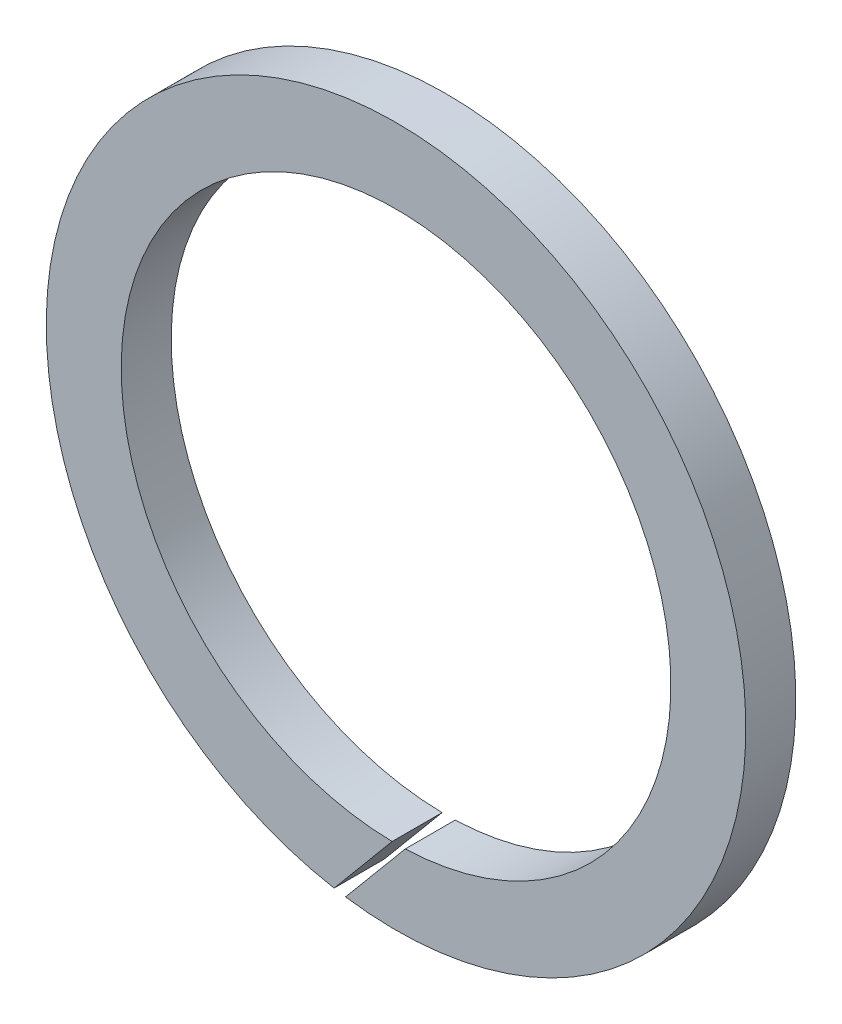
from build123d import *

# Parameters (mm, degrees)
ESQUISSE1_R             = 7
ESQUISSE1_R_2           = 5.5
BOSS_EXTRU_1_DEPTH      = 1
ENL_V_MAT_EXTRU_1_DEPTH = 10.949874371


with BuildPart() as part:
    # Esquisse1 → Boss.-Extru.1 (new body)
    with BuildSketch(Plane.XY):
        Circle(ESQUISSE1_R)
        Circle(ESQUISSE1_R_2, mode=Mode.SUBTRACT)
    extrude(amount=BOSS_EXTRU_1_DEPTH)

    # Esquisse2 → Enl_v. mat.-Extru.1 (cut, through all)
    with BuildSketch(Plane.XY.offset(1)):
        Polygon((0.885109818, -4.346674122), (-1.918906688, -7.700309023), (-1.65820883, -7.700309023), (1.492119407, -3.932481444), align=None)
    extrude(amount=-ENL_V_MAT_EXTRU_1_DEPTH, mode=Mode.SUBTRACT)


solid = part.part
